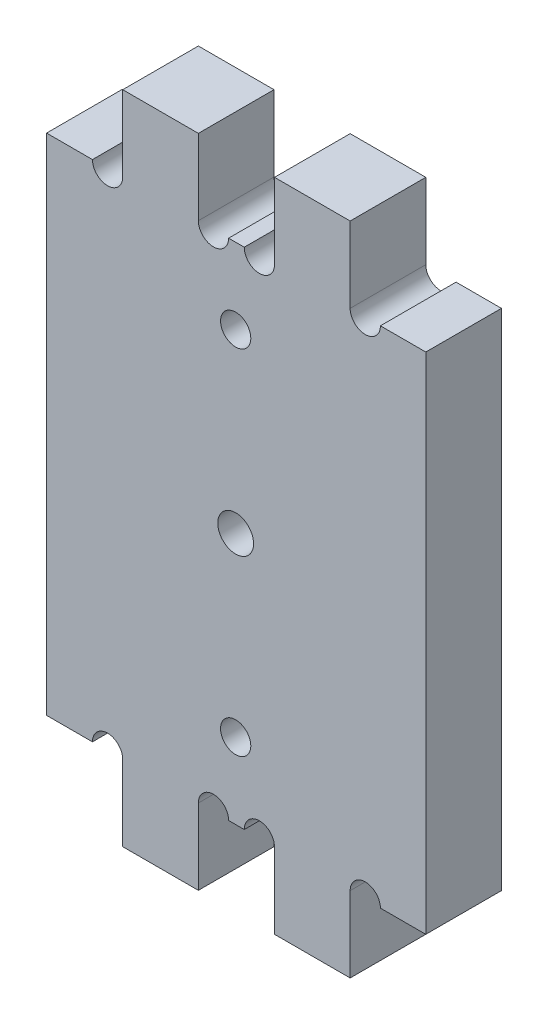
from build123d import *

# Parameters (mm, degrees)
AUFSATZ_LINEAR_AUSTRAGEN1_DEPTH = 15
SKIZZE2_R                       = 5.05
SCHNITT_LINEAR_AUSTRAGEN2_DEPTH = 7.5
SKIZZE3_R                       = 3.55
SKIZZE3_R_2                     = 3
SCHNITT_LINEAR_AUSTRAGEN3_DEPTH = 17.5


with BuildPart() as part:
    # Skizze1 → Aufsatz-Linear austragen1 (new body)
    with BuildSketch(Plane.XY):
        with BuildLine():
            Line((0, 0), (0, 100))
            Line((0, 100), (-9, 100))
            ThreePointArc((-9, 100), (-12, 97), (-15, 100))
            Line((-15, 100), (-15, 115))
            Line((-15, 115), (-30, 115))
            Line((-30, 115), (-30, 100))
            ThreePointArc((-30, 100), (-33, 97), (-36, 100))
            Line((-36, 100), (-39.1, 100))
            ThreePointArc((-39.1, 100), (-42.1, 97), (-45.1, 100))
            Line((-45.1, 100), (-45.1, 115))
            Line((-45.1, 115), (-60.1, 115))
            Line((-60.1, 115), (-60.1, 100))
            ThreePointArc((-60.1, 100), (-63.1, 97), (-66.1, 100))
            Line((-66.1, 100), (-75.2, 100))
            Line((-75.2, 100), (-75.2, 0))
            Line((-75.2, 0), (-66.1, 0))
            ThreePointArc((-66.1, 0), (-63.1, 3), (-60.1, 0))
            Line((-60.1, 0), (-60.1, -15))
            Line((-60.1, -15), (-45.1, -15))
            Line((-45.1, -15), (-45.1, 0))
            ThreePointArc((-45.1, 0), (-42.1, 3), (-39.1, 0))
            Line((-39.1, 0), (-36, 0))
            ThreePointArc((-36, 0), (-33, 3), (-30, 0))
            Line((-30, 0), (-30, -15))
            Line((-30, -15), (-15, -15))
            Line((-15, -15), (-15, 0))
            ThreePointArc((-15, 0), (-12, 3), (-9, 0))
            Line((-9, 0), (0, 0))
        make_face()
    extrude(amount=AUFSATZ_LINEAR_AUSTRAGEN1_DEPTH)

    # Skizze2 → Schnitt-Linear austragen2 (cut)
    with BuildSketch(Plane(origin=(0, 0, 0), x_dir=(-1, 0, 0), z_dir=(0, 0, -1))):
        with Locations((37.7, 85)):
            Circle(SKIZZE2_R)
        with Locations((37.7, 15)):
            Circle(SKIZZE2_R)
    extrude(amount=-SCHNITT_LINEAR_AUSTRAGEN2_DEPTH, mode=Mode.SUBTRACT)

    # Skizze3 → Schnitt-Linear austragen3 (cut)
    with BuildSketch(Plane(origin=(0, 0, 0), x_dir=(-1, 0, 0), z_dir=(0, 0, -1))):
        with Locations((37.7, 50)):
            Circle(SKIZZE3_R)
        with Locations((37.7, 85)):
            Circle(SKIZZE3_R_2)
        with Locations((37.7, 15)):
            Circle(SKIZZE3_R_2)
    extrude(amount=-SCHNITT_LINEAR_AUSTRAGEN3_DEPTH, mode=Mode.SUBTRACT)


solid = part.part
